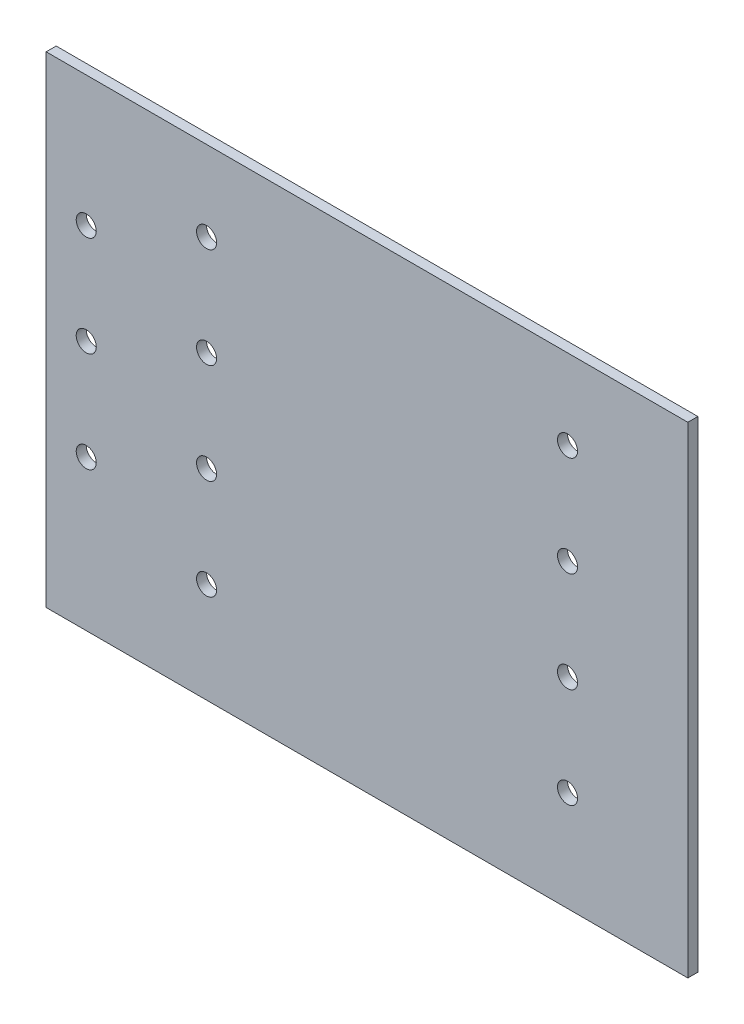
from build123d import *

# Parameters (mm, degrees)
SKETCH1_W            = 25.4
SKETCH1_H            = 1219.2
BOSS_EXTRUDE1_DEPTH  = 1625.6
CUT_EXTRUDE1_REACH   = 2034.159
SKETCH2_R            = 25.4
LPATTERN1_COUNT      = 2
LPATTERN1_PITCH      = 914.4
LPATTERN1_COUNT_DIR2 = 4
LPATTERN1_PITCH_DIR2 = 254
CUT_EXTRUDE2_REACH   = 2034.159
SKETCH3_R            = 25.4
LPATTERN2_COUNT      = 3
LPATTERN2_PITCH      = 254


with BuildPart() as part:
    # Sketch1 → Boss-Extrude1 (new body)
    with BuildSketch(Plane(origin=(0, 0, 0), x_dir=(0, 0, -1), z_dir=(1, 0, 0))):
        with Locations((12.7, 609.6)):
            Rectangle(SKETCH1_W, SKETCH1_H)
    extrude(amount=BOSS_EXTRUDE1_DEPTH)

    # Sketch2 → Cut-Extrude1 (cut, up to next)
    with BuildSketch(Plane.XY, mode=Mode.PRIVATE) as cut_extrude1_sk1:
        with Locations((1320.8, 254)):
            Circle(SKETCH2_R)
    cut_extrude1_tool1 = extrude(cut_extrude1_sk1.sketch, amount=-CUT_EXTRUDE1_REACH, mode=Mode.PRIVATE) & part.part
    cut_extrude1 = cut_extrude1_tool1.solids().sort_by_distance((1320.8, 254, 0))[0]
    add(cut_extrude1, mode=Mode.SUBTRACT)

    # LPattern1: Cut-Extrude1 2 × 4
    with Locations(*[(-i * LPATTERN1_PITCH, j * LPATTERN1_PITCH_DIR2, 0) for i in range(LPATTERN1_COUNT) for j in range(LPATTERN1_COUNT_DIR2) if (i, j) != (0, 0)]):
        add(cut_extrude1, mode=Mode.SUBTRACT)

    # Sketch3 → Cut-Extrude2 (cut, up to next)
    with BuildSketch(Plane.XY, mode=Mode.PRIVATE) as cut_extrude2_sk1:
        with Locations((101.6, 381)):
            Circle(SKETCH3_R)
    cut_extrude2_tool1 = extrude(cut_extrude2_sk1.sketch, amount=-CUT_EXTRUDE2_REACH, mode=Mode.PRIVATE) & part.part
    cut_extrude2 = cut_extrude2_tool1.solids().sort_by_distance((101.6, 381, 0))[0]
    add(cut_extrude2, mode=Mode.SUBTRACT)

    # LPattern2: Cut-Extrude2 ×3
    with Locations(*[(0, i * LPATTERN2_PITCH, 0) for i in range(1, LPATTERN2_COUNT)]):
        add(cut_extrude2, mode=Mode.SUBTRACT)


solid = part.part
